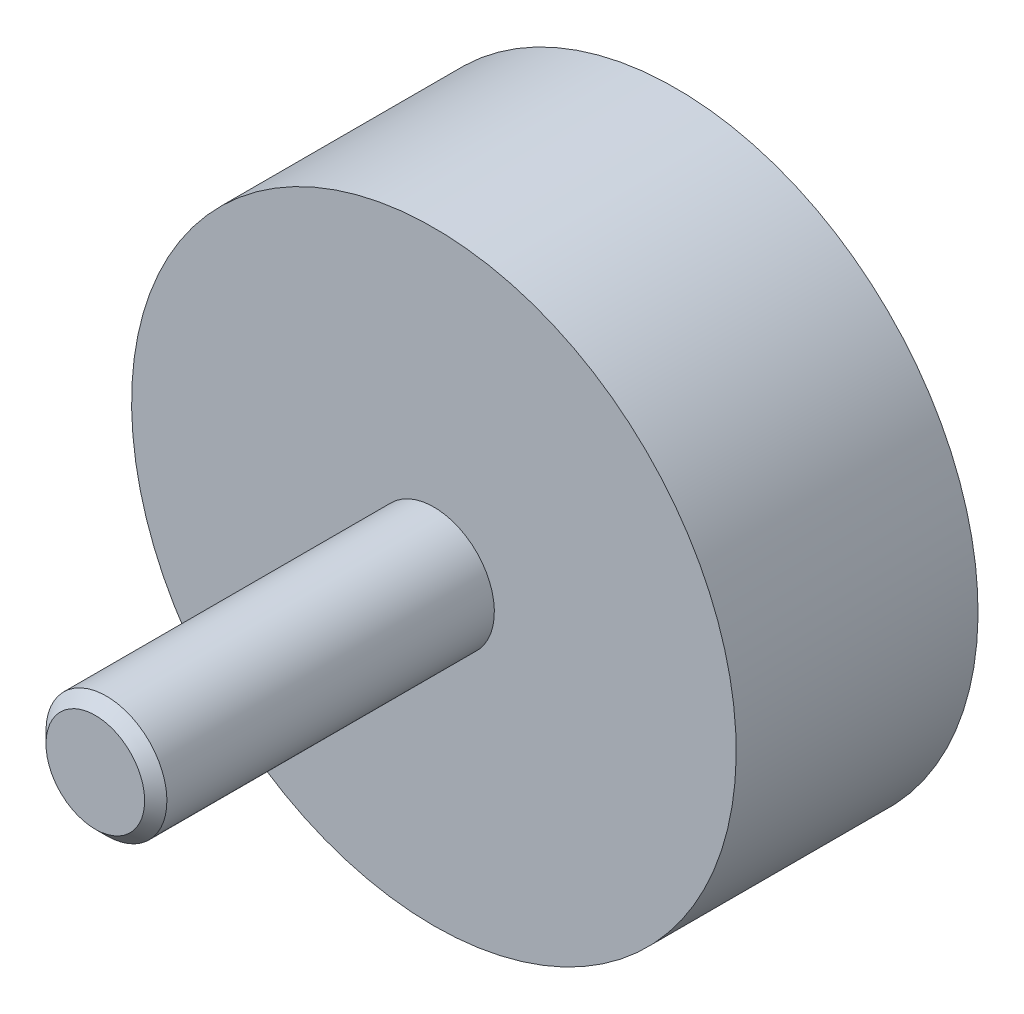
ISO-10303-21;
HEADER;
FILE_DESCRIPTION(('STEP AP214'),'2;1');
FILE_NAME('part.step','',(''),(''),'','','');
FILE_SCHEMA(('AUTOMOTIVE_DESIGN { 1 0 10303 214 1 1 1 1 }'));
ENDSEC;
DATA;
#1=APPLICATION_CONTEXT('core data for automotive mechanical design processes');
#2=APPLICATION_PROTOCOL_DEFINITION('international standard','automotive_design',2000,#1);
#3=PRODUCT_CONTEXT('',#1,'mechanical');
#4=PRODUCT('Part','Part','',(#3));
#5=PRODUCT_RELATED_PRODUCT_CATEGORY('part','',(#4));
#6=PRODUCT_DEFINITION_FORMATION('','',#4);
#7=PRODUCT_DEFINITION_CONTEXT('part definition',#1,'design');
#8=PRODUCT_DEFINITION('design','',#6,#7);
#9=PRODUCT_DEFINITION_SHAPE('','',#8);
#10=(LENGTH_UNIT() NAMED_UNIT(*) SI_UNIT(.MILLI.,.METRE.));
#11=(NAMED_UNIT(*) PLANE_ANGLE_UNIT() SI_UNIT($,.RADIAN.));
#12=(NAMED_UNIT(*) SI_UNIT($,.STERADIAN.) SOLID_ANGLE_UNIT());
#13=UNCERTAINTY_MEASURE_WITH_UNIT(LENGTH_MEASURE(1.E-05),#10,'distance_accuracy_value','');
#14=(GEOMETRIC_REPRESENTATION_CONTEXT(3) GLOBAL_UNCERTAINTY_ASSIGNED_CONTEXT((#13)) GLOBAL_UNIT_ASSIGNED_CONTEXT((#10,
#11,#12)) REPRESENTATION_CONTEXT('',''));
#15=CARTESIAN_POINT('',(0.,0.,0.));
#16=DIRECTION('',(0.,0.,1.));
#17=DIRECTION('',(1.,0.,0.));
#18=AXIS2_PLACEMENT_3D('',#15,#16,#17);
#19=CARTESIAN_POINT('',(23.333333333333,0.,20.));
#20=DIRECTION('',(0.,0.,1.));
#21=DIRECTION('',(0.,-1.,0.));
#22=AXIS2_PLACEMENT_3D('',#19,#20,#21);
#23=PLANE('',#22);
#24=CARTESIAN_POINT('',(0.,0.,20.));
#25=DIRECTION('',(0.,0.,1.));
#26=DIRECTION('',(0.,-1.,0.));
#27=AXIS2_PLACEMENT_3D('',#24,#25,#26);
#28=CIRCLE('',#27,5.);
#29=CARTESIAN_POINT('',(0.,-5.,20.));
#30=VERTEX_POINT('',#29);
#31=EDGE_CURVE('E23',#30,#30,#28,.T.);
#32=ORIENTED_EDGE('',*,*,#31,.F.);
#33=EDGE_LOOP('',(#32));
#34=FACE_BOUND('',#33,.T.);
#35=CARTESIAN_POINT('',(0.,0.,20.));
#36=DIRECTION('',(0.,0.,1.));
#37=DIRECTION('',(0.,-1.,0.));
#38=AXIS2_PLACEMENT_3D('',#35,#36,#37);
#39=CIRCLE('',#38,25.);
#40=CARTESIAN_POINT('',(0.,-25.,20.));
#41=VERTEX_POINT('',#40);
#42=EDGE_CURVE('E27',#41,#41,#39,.T.);
#43=ORIENTED_EDGE('',*,*,#42,.T.);
#44=EDGE_LOOP('',(#43));
#45=FACE_BOUND('',#44,.T.);
#46=ADVANCED_FACE('F12',(#34,#45),#23,.T.);
#47=CARTESIAN_POINT('',(0.,0.,0.66666666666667));
#48=DIRECTION('',(0.,0.,1.));
#49=DIRECTION('',(0.,-1.,0.));
#50=AXIS2_PLACEMENT_3D('',#47,#48,#49);
#51=CYLINDRICAL_SURFACE('',#50,25.);
#52=CARTESIAN_POINT('',(0.,0.,0.));
#53=DIRECTION('',(0.,0.,1.));
#54=DIRECTION('',(0.,-1.,0.));
#55=AXIS2_PLACEMENT_3D('',#52,#53,#54);
#56=CIRCLE('',#55,25.);
#57=CARTESIAN_POINT('',(0.,-25.,0.));
#58=VERTEX_POINT('',#57);
#59=EDGE_CURVE('E32',#58,#58,#56,.T.);
#60=ORIENTED_EDGE('',*,*,#59,.T.);
#61=EDGE_LOOP('',(#60));
#62=FACE_BOUND('',#61,.T.);
#63=ORIENTED_EDGE('',*,*,#42,.F.);
#64=EDGE_LOOP('',(#63));
#65=FACE_BOUND('',#64,.T.);
#66=ADVANCED_FACE('F63',(#62,#65),#51,.T.);
#67=CARTESIAN_POINT('',(25.,0.,0.));
#68=DIRECTION('',(0.,0.,-1.));
#69=DIRECTION('',(0.,1.,0.));
#70=AXIS2_PLACEMENT_3D('',#67,#68,#69);
#71=PLANE('',#70);
#72=CARTESIAN_POINT('',(0.,0.,0.));
#73=DIRECTION('',(0.,0.,-1.));
#74=DIRECTION('',(0.,1.,0.));
#75=AXIS2_PLACEMENT_3D('',#72,#73,#74);
#76=CIRCLE('',#75,5.65);
#77=CARTESIAN_POINT('',(0.,5.65,0.));
#78=VERTEX_POINT('',#77);
#79=EDGE_CURVE('E8',#78,#78,#76,.F.);
#80=ORIENTED_EDGE('',*,*,#79,.T.);
#81=EDGE_LOOP('',(#80));
#82=FACE_BOUND('',#81,.T.);
#83=ORIENTED_EDGE('',*,*,#59,.F.);
#84=EDGE_LOOP('',(#83));
#85=FACE_BOUND('',#84,.T.);
#86=ADVANCED_FACE('F68',(#82,#85),#71,.T.);
#87=CARTESIAN_POINT('',(0.,0.,48.));
#88=DIRECTION('',(0.,0.,1.));
#89=DIRECTION('',(0.,-1.,0.));
#90=AXIS2_PLACEMENT_3D('',#87,#88,#89);
#91=PLANE('',#90);
#92=CARTESIAN_POINT('',(0.,0.,48.));
#93=DIRECTION('',(0.,0.,1.));
#94=DIRECTION('',(0.,-1.,0.));
#95=AXIS2_PLACEMENT_3D('',#92,#93,#94);
#96=CIRCLE('',#95,4.08);
#97=CARTESIAN_POINT('',(0.,-4.08,48.));
#98=VERTEX_POINT('',#97);
#99=EDGE_CURVE('E35',#98,#98,#96,.T.);
#100=ORIENTED_EDGE('',*,*,#99,.T.);
#101=EDGE_LOOP('',(#100));
#102=FACE_BOUND('',#101,.T.);
#103=ADVANCED_FACE('F74',(#102),#91,.T.);
#104=CARTESIAN_POINT('',(0.,0.,48.));
#105=DIRECTION('',(0.,0.,-1.));
#106=DIRECTION('',(0.,1.,0.));
#107=AXIS2_PLACEMENT_3D('',#104,#105,#106);
#108=CONICAL_SURFACE('',#107,4.08,0.785398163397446);
#109=CARTESIAN_POINT('',(0.,0.,47.08));
#110=DIRECTION('',(0.,0.,1.));
#111=DIRECTION('',(0.,-1.,0.));
#112=AXIS2_PLACEMENT_3D('',#109,#110,#111);
#113=CIRCLE('',#112,5.);
#114=CARTESIAN_POINT('',(0.,-5.,47.08));
#115=VERTEX_POINT('',#114);
#116=EDGE_CURVE('E38',#115,#115,#113,.T.);
#117=ORIENTED_EDGE('',*,*,#116,.T.);
#118=EDGE_LOOP('',(#117));
#119=FACE_BOUND('',#118,.T.);
#120=ORIENTED_EDGE('',*,*,#99,.F.);
#121=EDGE_LOOP('',(#120));
#122=FACE_BOUND('',#121,.T.);
#123=ADVANCED_FACE('F57',(#119,#122),#108,.T.);
#124=CARTESIAN_POINT('',(0.,0.,20.));
#125=DIRECTION('',(0.,0.,1.));
#126=DIRECTION('',(0.,-1.,0.));
#127=AXIS2_PLACEMENT_3D('',#124,#125,#126);
#128=CYLINDRICAL_SURFACE('',#127,5.);
#129=ORIENTED_EDGE('',*,*,#31,.T.);
#130=EDGE_LOOP('',(#129));
#131=FACE_BOUND('',#130,.T.);
#132=ORIENTED_EDGE('',*,*,#116,.F.);
#133=EDGE_LOOP('',(#132));
#134=FACE_BOUND('',#133,.T.);
#135=ADVANCED_FACE('F49',(#131,#134),#128,.T.);
#136=CARTESIAN_POINT('',(0.,0.,0.));
#137=DIRECTION('',(0.,0.,1.));
#138=DIRECTION('',(0.,-1.,0.));
#139=AXIS2_PLACEMENT_3D('',#136,#137,#138);
#140=CYLINDRICAL_SURFACE('',#139,5.);
#141=CARTESIAN_POINT('',(0.,0.,0.65));
#142=DIRECTION('',(0.,0.,-1.));
#143=DIRECTION('',(0.,1.,0.));
#144=AXIS2_PLACEMENT_3D('',#141,#142,#143);
#145=CIRCLE('',#144,5.);
#146=CARTESIAN_POINT('',(0.,5.,0.65));
#147=VERTEX_POINT('',#146);
#148=EDGE_CURVE('E19',#147,#147,#145,.T.);
#149=ORIENTED_EDGE('',*,*,#148,.T.);
#150=EDGE_LOOP('',(#149));
#151=FACE_BOUND('',#150,.T.);
#152=CARTESIAN_POINT('',(0.,0.,10.));
#153=DIRECTION('',(0.,0.,-1.));
#154=DIRECTION('',(0.,1.,0.));
#155=AXIS2_PLACEMENT_3D('',#152,#153,#154);
#156=CIRCLE('',#155,5.);
#157=CARTESIAN_POINT('',(0.,5.,10.));
#158=VERTEX_POINT('',#157);
#159=EDGE_CURVE('E41',#158,#158,#156,.T.);
#160=ORIENTED_EDGE('',*,*,#159,.F.);
#161=EDGE_LOOP('',(#160));
#162=FACE_BOUND('',#161,.T.);
#163=ADVANCED_FACE('F47',(#151,#162),#140,.F.);
#164=CARTESIAN_POINT('',(0.,0.,10.));
#165=DIRECTION('',(0.,0.,-1.));
#166=DIRECTION('',(0.,1.,0.));
#167=AXIS2_PLACEMENT_3D('',#164,#165,#166);
#168=PLANE('',#167);
#169=ORIENTED_EDGE('',*,*,#159,.T.);
#170=EDGE_LOOP('',(#169));
#171=FACE_BOUND('',#170,.T.);
#172=ADVANCED_FACE('F45',(#171),#168,.T.);
#173=CARTESIAN_POINT('',(0.,0.,0.65));
#174=DIRECTION('',(0.,0.,-1.));
#175=DIRECTION('',(0.,1.,0.));
#176=AXIS2_PLACEMENT_3D('',#173,#174,#175);
#177=CONICAL_SURFACE('',#176,5.,0.785398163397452);
#178=ORIENTED_EDGE('',*,*,#79,.F.);
#179=EDGE_LOOP('',(#178));
#180=FACE_BOUND('',#179,.T.);
#181=ORIENTED_EDGE('',*,*,#148,.F.);
#182=EDGE_LOOP('',(#181));
#183=FACE_BOUND('',#182,.T.);
#184=ADVANCED_FACE('F14',(#180,#183),#177,.F.);
#185=CLOSED_SHELL('',(#46,#66,#86,#103,#123,#135,#163,#172,#184));
#186=MANIFOLD_SOLID_BREP('B1',#185);
#187=ADVANCED_BREP_SHAPE_REPRESENTATION('',(#18,#186),#14);
#188=SHAPE_DEFINITION_REPRESENTATION(#9,#187);
ENDSEC;
END-ISO-10303-21;
